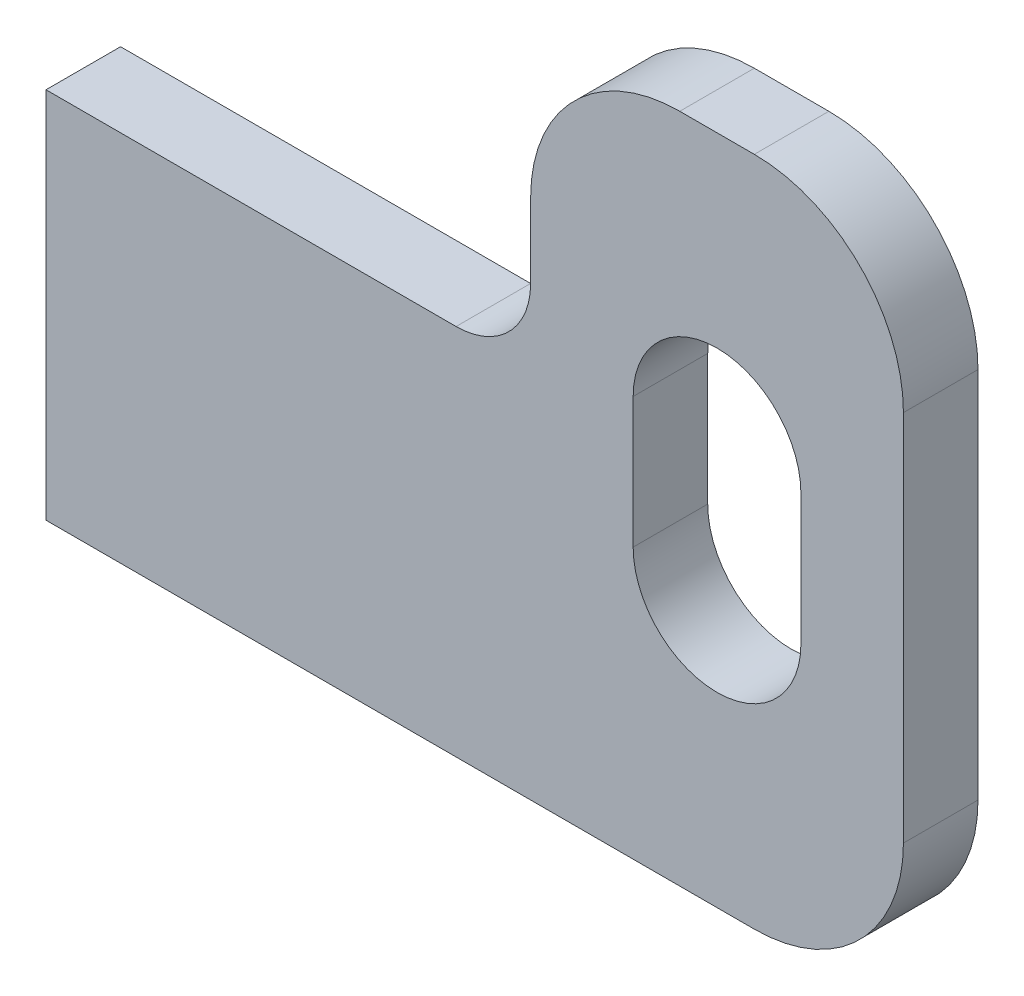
from build123d import *

# Parameters (mm, degrees)
EXTRUDE1_DEPTH = 6.35


with BuildPart() as part:
    # Sketch1 → Extrude1 (new body)
    with BuildSketch(Plane.XY):
        with BuildLine():
            Line((-22.225, 3.175), (-57.15, 3.175))
            Line((-57.15, 3.175), (-57.15, -28.575))
            Line((-57.15, -28.575), (3.175, -28.575))
            ThreePointArc((3.175, -28.575), (12.155256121, -24.855256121), (15.875, -15.875))
            Line((15.875, -15.875), (15.875, 15.875))
            ThreePointArc((15.875, 15.875), (12.155256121, 24.855256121), (3.175, 28.575))
            Line((3.175, 28.575), (-3.175, 28.575))
            ThreePointArc((-3.175, 28.575), (-12.155256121, 24.855256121), (-15.875, 15.875))
            Line((-15.875, 15.875), (-15.875, 9.525))
            ThreePointArc((-15.875, 9.525), (-17.734871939, 5.034871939), (-22.225, 3.175))
        make_face()
        with BuildLine():
            Line((7.14375, -5.55625), (7.14375, 5.55625))
            ThreePointArc((7.14375, 5.55625), (0, 12.7), (-7.14375, 5.55625))
            Line((-7.14375, 5.55625), (-7.14375, -5.55625))
            ThreePointArc((-7.14375, -5.55625), (0, -12.7), (7.14375, -5.55625))
        make_face(mode=Mode.SUBTRACT)
    extrude(amount=EXTRUDE1_DEPTH)


solid = part.part
